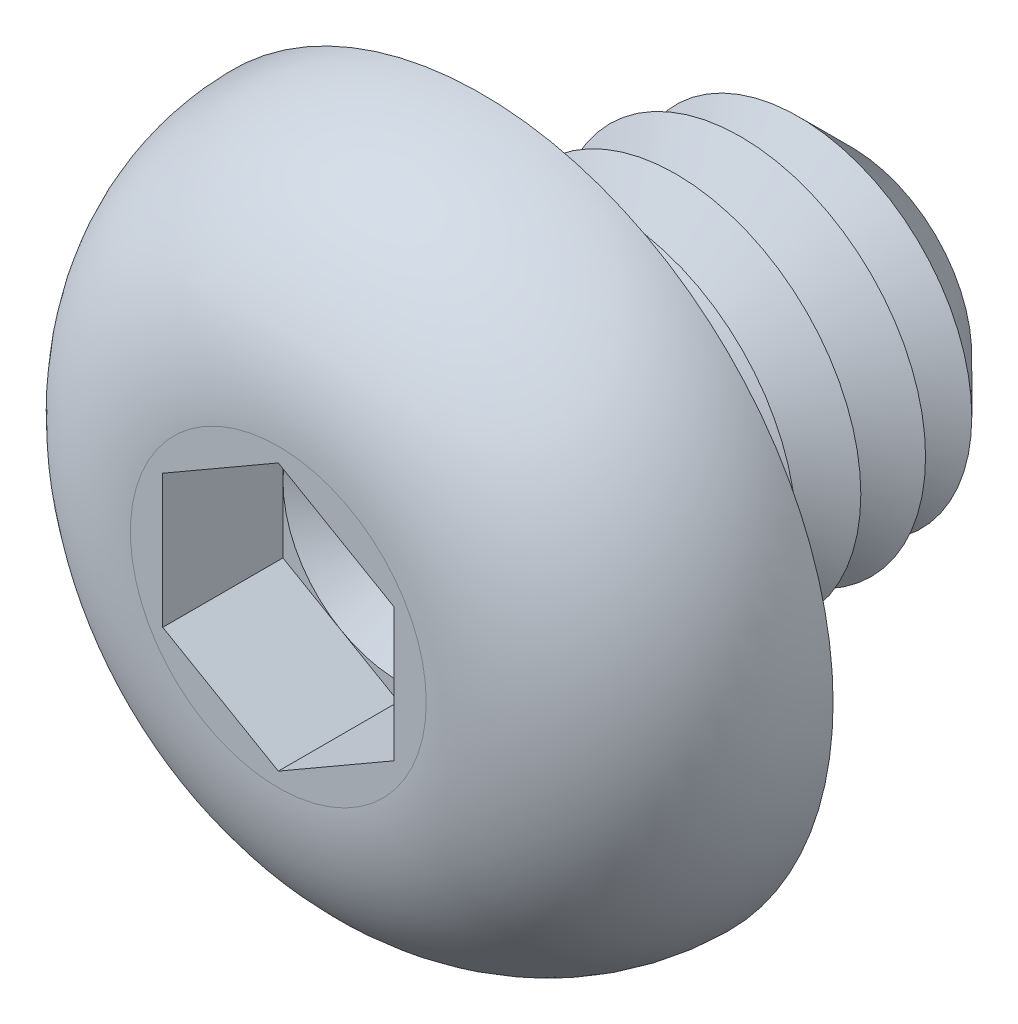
from build123d import *

# Parameters (mm, degrees)
CUT_EXTRUDE1_DEPTH  = 1.3
SKETCH4_R           = 2
BOSS_EXTRUDE1_DEPTH = 4
CHAMFER1_SIZE       = 0.7
LPATTERN1_COUNT     = 4
LPATTERN1_PITCH     = 0.7
FILLET2_R           = 0.3


with BuildPart() as part:
    # Sketch2 → Revolve1 (revolve)
    with BuildSketch(Plane(origin=(0, 0, 0), x_dir=(0, 0, -1), z_dir=(1, 0, 0)), mode=Mode.PRIVATE) as revolve1_sk:
        with BuildLine():
            Line((0, 0), (-2.2, 0))
            Line((-2.2, 0), (-2.2, 1.6))
            ThreePointArc((-2.2, 1.6), (-1.555634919, 3.155634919), (0, 3.8))
            Line((0, 3.8), (0, 0))
        make_face()
    revolve(revolve1_sk.sketch.rotate(Axis((0, 0, 47.934239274), (0, 0, -1)), 90), axis=Axis((0, 0, 47.934239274), (0, 0, -1)))

    # Sketch3 → Cut-Extrude1 (cut)
    with BuildSketch(Plane.XY.offset(2.2)):
        Polygon((0, 1.443375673), (-1.25, 0.721687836), (-1.25, -0.721687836), (0, -1.443375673), (1.25, -0.721687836), (1.25, 0.721687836), align=None)
    extrude(amount=-CUT_EXTRUDE1_DEPTH, mode=Mode.SUBTRACT)

    # Sketch4 → Boss-Extrude1 (add)
    with BuildSketch(Plane(origin=(0, 0, 0), x_dir=(-1, 0, 0), z_dir=(0, 0, -1))):
        with Locations(Location((0, 0, 0), (0, 0, 180))):
            Circle(SKETCH4_R)
    extrude(amount=BOSS_EXTRUDE1_DEPTH)

    # Chamfer1
    chamfer1_edges = [part.edges().sort_by_distance(p)[0] for p in [
        (-2, 0, -4),
    ]]
    chamfer(chamfer1_edges, length=CHAMFER1_SIZE)

    # Sketch5 → Cut-Revolve1 (revolve, cut)
    with BuildSketch(Plane(origin=(0, 0, 0), x_dir=(0, 0, -1), z_dir=(1, 0, 0)), mode=Mode.PRIVATE) as cut_revolve1_sk:
        Polygon((0.7, 2), (1.4, 2), (1.05, 1.393782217), align=None)
    cut_revolve1 = revolve(cut_revolve1_sk.sketch.rotate(Axis((0, 0, 47.934239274), (0, 0, -1)), 90), axis=Axis((0, 0, 47.934239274), (0, 0, -1)), mode=Mode.SUBTRACT)

    # LPattern1: Cut-Revolve1 ×4
    with Locations(*[(0, 0, -i * LPATTERN1_PITCH) for i in range(1, LPATTERN1_COUNT)]):
        add(cut_revolve1, mode=Mode.SUBTRACT)

    # Fillet2
    fillet2_edges = [part.edges().sort_by_distance(p)[0] for p in [
        (-2, 0, 0),
    ]]
    fillet(fillet2_edges, radius=FILLET2_R)

    # Cut-Extrude2 cone 1 section (on through the dimple's axis) → Cut-Extrude2 (revolve, cut)
    with BuildSketch(Plane(origin=(0, 0, 0.9), x_dir=(0, -1, 0), z_dir=(1, 0, 0))):
        Polygon((0, 0), (1.25, 0), (0, 0.721687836), align=None)
    revolve(axis=Axis((0, 0, 0.9), (0, 0, -1)), mode=Mode.SUBTRACT)


solid = part.part
